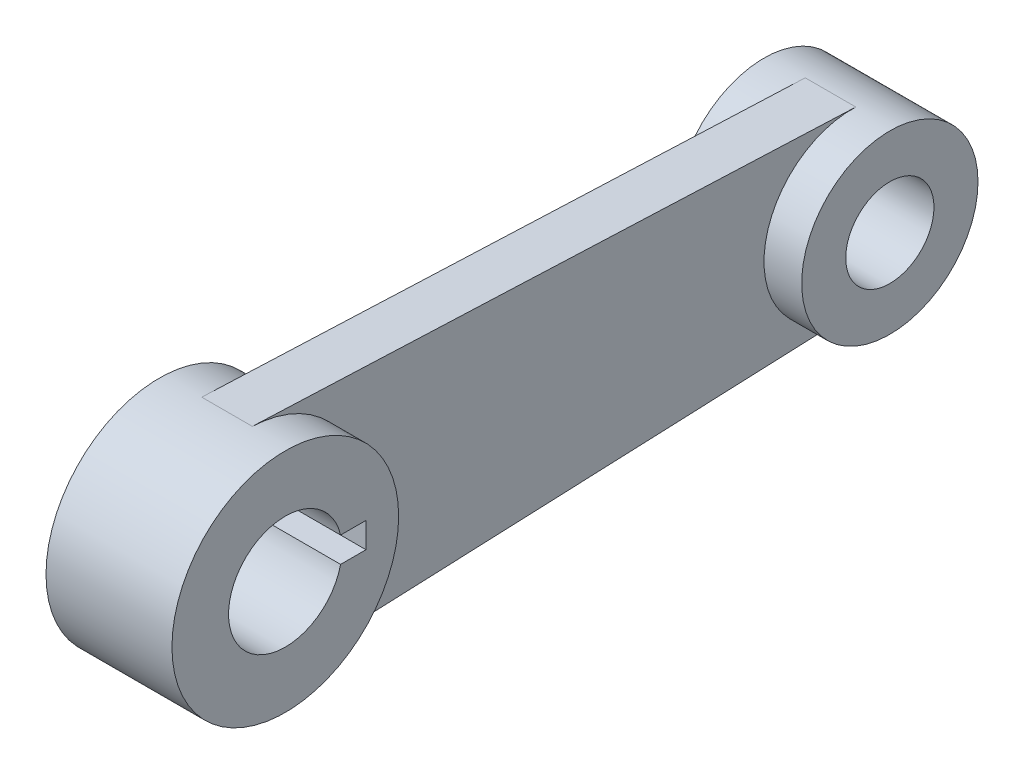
from build123d import *

# Parameters (mm, degrees)
SKETCH1_R        = 14.2875
EXTRUDE1_DEPTH   = 7.9375
SKETCH1_R_2      = 11.1125
SKETCH1_R_3      = 5.5626
EXTRUDE1_2_DEPTH = 7.9375
EXTRUDE2_START   = 3.1877
EXTRUDE2_DEPTH   = 3.1877


with BuildPart() as part:
    # Sketch1 → Extrude1 (new, symmetric)
    with BuildSketch(Plane(origin=(0, 0, 0), x_dir=(0, 0, -1), z_dir=(1, 0, 0))):
        Circle(SKETCH1_R)
        with BuildLine():
            Line((6.968736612, 1.6002), (10.169136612, 1.6002))
            Line((10.169136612, 1.6002), (10.169136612, -1.6002))
            Line((10.169136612, -1.6002), (6.968736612, -1.6002))
            ThreePointArc((6.968736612, -1.6002), (-7.1501, 0), (6.968736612, 1.6002))
        make_face(mode=Mode.SUBTRACT)
    extrude(amount=EXTRUDE1_DEPTH, both=True)



with BuildPart() as body_2:
    # Sketch1 → Extrude1 2 (new, symmetric)
    with BuildSketch(Plane(origin=(0, 0, 0), x_dir=(0, 0, -1), z_dir=(1, 0, 0))):
        with Locations((76.2, 0)):
            Circle(SKETCH1_R_2)
        with Locations((76.2, 0)):
            Circle(SKETCH1_R_3, mode=Mode.SUBTRACT)
    extrude(amount=EXTRUDE1_2_DEPTH, both=True)


with BuildPart() as part_1:
    add(part.part)

    add(body_2.part)  # Extrude2 merges body 2
    # Sketch1_3 → Extrude2 (add)
    with BuildSketch(Plane(origin=(0, 0, 0), x_dir=(0, 0, -1), z_dir=(1, 0, 0)).offset(EXTRUDE2_START)):
        with BuildLine():
            ThreePointArc((0.5953125, 14.275092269), (10.311114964, 9.890074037), (14.2875, 0))
            Line((14.2875, 0), (65.0875, 0))
            ThreePointArc((65.0875, 0), (68.507720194, 8.019756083), (76.663020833, 11.102849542))
            Line((76.663020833, 11.102849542), (0.5953125, 14.275092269))
        make_face()
        with BuildLine():
            Line((65.0875, 0), (14.2875, 0))
            ThreePointArc((14.2875, 0), (10.311114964, -9.890074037), (0.5953125, -14.275092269))
            Line((0.5953125, -14.275092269), (76.663020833, -11.102849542))
            ThreePointArc((76.663020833, -11.102849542), (68.507720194, -8.019756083), (65.0875, 0))
        make_face()
    extrude2 = extrude(amount=-EXTRUDE2_DEPTH)

    # Mirror2: Extrude2 across plane
    add(extrude2.mirror(Plane(origin=(0, 0, -118.746246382), x_dir=(0, 0, 1), z_dir=(1, 0, 0))))


solid = part_1.part
